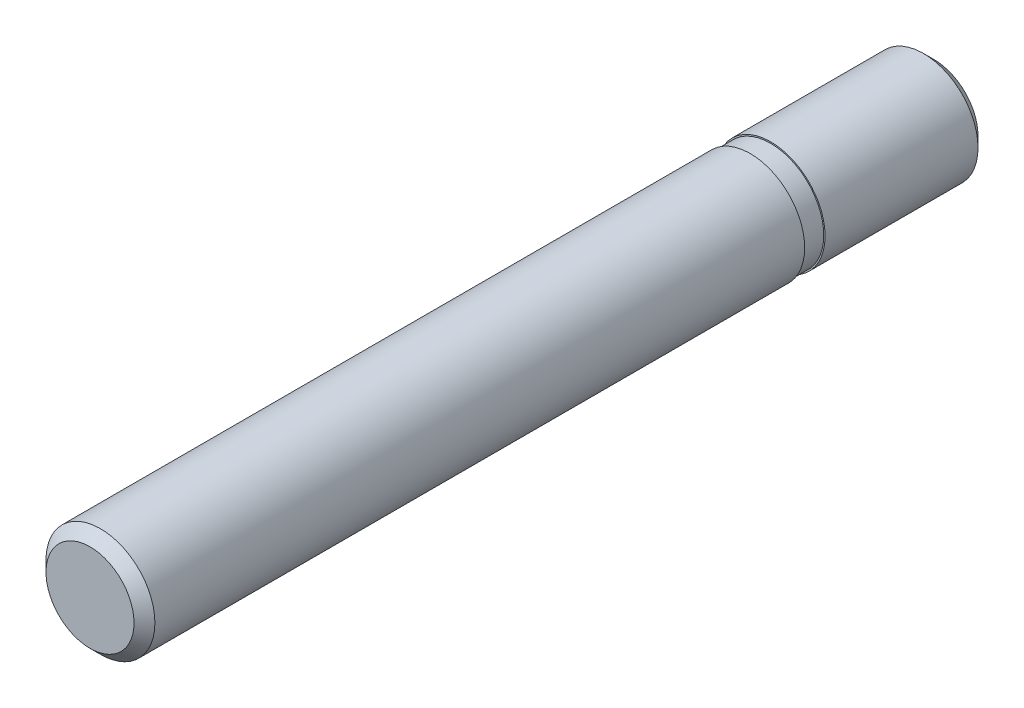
ISO-10303-21;
HEADER;
FILE_DESCRIPTION(('STEP AP214'),'2;1');
FILE_NAME('part.step','',(''),(''),'','','');
FILE_SCHEMA(('AUTOMOTIVE_DESIGN { 1 0 10303 214 1 1 1 1 }'));
ENDSEC;
DATA;
#1=APPLICATION_CONTEXT('core data for automotive mechanical design processes');
#2=APPLICATION_PROTOCOL_DEFINITION('international standard','automotive_design',2000,#1);
#3=PRODUCT_CONTEXT('',#1,'mechanical');
#4=PRODUCT('Part','Part','',(#3));
#5=PRODUCT_RELATED_PRODUCT_CATEGORY('part','',(#4));
#6=PRODUCT_DEFINITION_FORMATION('','',#4);
#7=PRODUCT_DEFINITION_CONTEXT('part definition',#1,'design');
#8=PRODUCT_DEFINITION('design','',#6,#7);
#9=PRODUCT_DEFINITION_SHAPE('','',#8);
#10=(LENGTH_UNIT() NAMED_UNIT(*) SI_UNIT(.MILLI.,.METRE.));
#11=(NAMED_UNIT(*) PLANE_ANGLE_UNIT() SI_UNIT($,.RADIAN.));
#12=(NAMED_UNIT(*) SI_UNIT($,.STERADIAN.) SOLID_ANGLE_UNIT());
#13=UNCERTAINTY_MEASURE_WITH_UNIT(LENGTH_MEASURE(1.E-05),#10,'distance_accuracy_value','');
#14=(GEOMETRIC_REPRESENTATION_CONTEXT(3) GLOBAL_UNCERTAINTY_ASSIGNED_CONTEXT((#13)) GLOBAL_UNIT_ASSIGNED_CONTEXT((#10,
#11,#12)) REPRESENTATION_CONTEXT('',''));
#15=CARTESIAN_POINT('',(0.,0.,0.));
#16=DIRECTION('',(0.,0.,1.));
#17=DIRECTION('',(1.,0.,0.));
#18=AXIS2_PLACEMENT_3D('',#15,#16,#17);
#19=CARTESIAN_POINT('',(0.,1.6165,-12.));
#20=DIRECTION('',(0.,0.,-1.));
#21=DIRECTION('',(-1.,0.,0.));
#22=AXIS2_PLACEMENT_3D('',#19,#20,#21);
#23=PLANE('',#22);
#24=CARTESIAN_POINT('',(0.,0.,-12.0000000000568));
#25=DIRECTION('',(0.,0.,1.));
#26=DIRECTION('',(1.,0.,0.));
#27=AXIS2_PLACEMENT_3D('',#24,#25,#26);
#28=CIRCLE('',#27,3.23300000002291);
#29=CARTESIAN_POINT('',(3.23300000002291,0.,-12.0000000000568));
#30=VERTEX_POINT('',#29);
#31=EDGE_CURVE('E19',#30,#30,#28,.T.);
#32=ORIENTED_EDGE('',*,*,#31,.F.);
#33=EDGE_LOOP('',(#32));
#34=FACE_BOUND('',#33,.T.);
#35=ADVANCED_FACE('F12',(#34),#23,.T.);
#36=CARTESIAN_POINT('',(0.,0.,-11.2330000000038));
#37=DIRECTION('',(0.,0.,1.));
#38=DIRECTION('',(1.,0.,0.));
#39=AXIS2_PLACEMENT_3D('',#36,#37,#38);
#40=CONICAL_SURFACE('',#39,4.00000000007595,0.785398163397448);
#41=CARTESIAN_POINT('',(0.,0.,-11.233));
#42=DIRECTION('',(0.,0.,1.));
#43=DIRECTION('',(1.,0.,0.));
#44=AXIS2_PLACEMENT_3D('',#41,#42,#43);
#45=CIRCLE('',#44,4.);
#46=CARTESIAN_POINT('',(4.,0.,-11.233));
#47=VERTEX_POINT('',#46);
#48=EDGE_CURVE('E23',#47,#47,#45,.T.);
#49=ORIENTED_EDGE('',*,*,#48,.F.);
#50=EDGE_LOOP('',(#49));
#51=FACE_BOUND('',#50,.T.);
#52=ORIENTED_EDGE('',*,*,#31,.T.);
#53=EDGE_LOOP('',(#52));
#54=FACE_BOUND('',#53,.T.);
#55=ADVANCED_FACE('F66',(#51,#54),#40,.T.);
#56=CARTESIAN_POINT('',(0.,0.,4.75));
#57=DIRECTION('',(0.,0.,1.));
#58=DIRECTION('',(1.,0.,0.));
#59=AXIS2_PLACEMENT_3D('',#56,#57,#58);
#60=CYLINDRICAL_SURFACE('',#59,4.);
#61=CARTESIAN_POINT('',(0.,0.,0.));
#62=DIRECTION('',(0.,0.,1.));
#63=DIRECTION('',(1.,0.,0.));
#64=AXIS2_PLACEMENT_3D('',#61,#62,#63);
#65=CIRCLE('',#64,4.);
#66=CARTESIAN_POINT('',(4.,0.,0.));
#67=VERTEX_POINT('',#66);
#68=EDGE_CURVE('E28',#67,#67,#65,.T.);
#69=ORIENTED_EDGE('',*,*,#68,.F.);
#70=EDGE_LOOP('',(#69));
#71=FACE_BOUND('',#70,.T.);
#72=ORIENTED_EDGE('',*,*,#48,.T.);
#73=EDGE_LOOP('',(#72));
#74=FACE_BOUND('',#73,.T.);
#75=ADVANCED_FACE('F72',(#71,#74),#60,.T.);
#76=CARTESIAN_POINT('',(0.,0.,0.));
#77=DIRECTION('',(0.,0.,1.));
#78=DIRECTION('',(1.,0.,0.));
#79=AXIS2_PLACEMENT_3D('',#76,#77,#78);
#80=PLANE('',#79);
#81=CARTESIAN_POINT('',(0.,0.,0.));
#82=DIRECTION('',(0.,0.,1.));
#83=DIRECTION('',(1.,0.,0.));
#84=AXIS2_PLACEMENT_3D('',#81,#82,#83);
#85=CIRCLE('',#84,3.9);
#86=CARTESIAN_POINT('',(3.9,0.,0.));
#87=VERTEX_POINT('',#86);
#88=EDGE_CURVE('E8',#87,#87,#85,.T.);
#89=ORIENTED_EDGE('',*,*,#88,.F.);
#90=EDGE_LOOP('',(#89));
#91=FACE_BOUND('',#90,.T.);
#92=ORIENTED_EDGE('',*,*,#68,.T.);
#93=EDGE_LOOP('',(#92));
#94=FACE_BOUND('',#93,.T.);
#95=ADVANCED_FACE('F77',(#91,#94),#80,.T.);
#96=CARTESIAN_POINT('',(0.,0.,-2.69116718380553));
#97=DIRECTION('',(0.,0.,-1.));
#98=DIRECTION('',(-1.,0.,0.));
#99=AXIS2_PLACEMENT_3D('',#96,#97,#98);
#100=CYLINDRICAL_SURFACE('',#99,3.9);
#101=CARTESIAN_POINT('',(0.,0.,1.5));
#102=DIRECTION('',(0.,0.,-1.));
#103=DIRECTION('',(-1.,0.,0.));
#104=AXIS2_PLACEMENT_3D('',#101,#102,#103);
#105=CIRCLE('',#104,3.9);
#106=CARTESIAN_POINT('',(-3.9,0.,1.5));
#107=VERTEX_POINT('',#106);
#108=EDGE_CURVE('E44',#107,#107,#105,.T.);
#109=ORIENTED_EDGE('',*,*,#108,.T.);
#110=EDGE_LOOP('',(#109));
#111=FACE_BOUND('',#110,.T.);
#112=ORIENTED_EDGE('',*,*,#88,.T.);
#113=EDGE_LOOP('',(#112));
#114=FACE_BOUND('',#113,.T.);
#115=ADVANCED_FACE('F51',(#111,#114),#100,.T.);
#116=CARTESIAN_POINT('',(0.,0.,50.));
#117=DIRECTION('',(0.,0.,1.));
#118=DIRECTION('',(1.,0.,0.));
#119=AXIS2_PLACEMENT_3D('',#116,#117,#118);
#120=PLANE('',#119);
#121=CARTESIAN_POINT('',(0.,0.,50.));
#122=DIRECTION('',(0.,0.,1.));
#123=DIRECTION('',(1.,0.,0.));
#124=AXIS2_PLACEMENT_3D('',#121,#122,#123);
#125=CIRCLE('',#124,3.233);
#126=CARTESIAN_POINT('',(3.233,0.,50.));
#127=VERTEX_POINT('',#126);
#128=EDGE_CURVE('E40',#127,#127,#125,.T.);
#129=ORIENTED_EDGE('',*,*,#128,.T.);
#130=EDGE_LOOP('',(#129));
#131=FACE_BOUND('',#130,.T.);
#132=ADVANCED_FACE('F85',(#131),#120,.T.);
#133=CARTESIAN_POINT('',(0.,0.,50.));
#134=DIRECTION('',(0.,0.,-1.));
#135=DIRECTION('',(-1.,0.,0.));
#136=AXIS2_PLACEMENT_3D('',#133,#134,#135);
#137=CONICAL_SURFACE('',#136,3.233,0.785398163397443);
#138=CARTESIAN_POINT('',(0.,0.,49.233));
#139=DIRECTION('',(0.,0.,1.));
#140=DIRECTION('',(1.,0.,0.));
#141=AXIS2_PLACEMENT_3D('',#138,#139,#140);
#142=CIRCLE('',#141,4.);
#143=CARTESIAN_POINT('',(4.,0.,49.233));
#144=VERTEX_POINT('',#143);
#145=EDGE_CURVE('E31',#144,#144,#142,.F.);
#146=ORIENTED_EDGE('',*,*,#145,.F.);
#147=EDGE_LOOP('',(#146));
#148=FACE_BOUND('',#147,.T.);
#149=ORIENTED_EDGE('',*,*,#128,.F.);
#150=EDGE_LOOP('',(#149));
#151=FACE_BOUND('',#150,.T.);
#152=ADVANCED_FACE('F62',(#148,#151),#137,.T.);
#153=CARTESIAN_POINT('',(0.,0.,4.75));
#154=DIRECTION('',(0.,0.,1.));
#155=DIRECTION('',(1.,0.,0.));
#156=AXIS2_PLACEMENT_3D('',#153,#154,#155);
#157=CYLINDRICAL_SURFACE('',#156,4.);
#158=CARTESIAN_POINT('',(0.,0.,1.5));
#159=DIRECTION('',(0.,0.,1.));
#160=DIRECTION('',(1.,0.,0.));
#161=AXIS2_PLACEMENT_3D('',#158,#159,#160);
#162=CIRCLE('',#161,4.);
#163=CARTESIAN_POINT('',(4.,0.,1.5));
#164=VERTEX_POINT('',#163);
#165=EDGE_CURVE('E35',#164,#164,#162,.T.);
#166=ORIENTED_EDGE('',*,*,#165,.T.);
#167=EDGE_LOOP('',(#166));
#168=FACE_BOUND('',#167,.T.);
#169=ORIENTED_EDGE('',*,*,#145,.T.);
#170=EDGE_LOOP('',(#169));
#171=FACE_BOUND('',#170,.T.);
#172=ADVANCED_FACE('F14',(#168,#171),#157,.T.);
#173=CARTESIAN_POINT('',(0.,0.,1.5));
#174=DIRECTION('',(0.,0.,1.));
#175=DIRECTION('',(1.,0.,0.));
#176=AXIS2_PLACEMENT_3D('',#173,#174,#175);
#177=PLANE('',#176);
#178=ORIENTED_EDGE('',*,*,#108,.F.);
#179=EDGE_LOOP('',(#178));
#180=FACE_BOUND('',#179,.T.);
#181=ORIENTED_EDGE('',*,*,#165,.F.);
#182=EDGE_LOOP('',(#181));
#183=FACE_BOUND('',#182,.T.);
#184=ADVANCED_FACE('F53',(#180,#183),#177,.F.);
#185=CLOSED_SHELL('',(#35,#55,#75,#95,#115,#132,#152,#172,#184));
#186=MANIFOLD_SOLID_BREP('B1',#185);
#187=ADVANCED_BREP_SHAPE_REPRESENTATION('',(#18,#186),#14);
#188=SHAPE_DEFINITION_REPRESENTATION(#9,#187);
ENDSEC;
END-ISO-10303-21;
